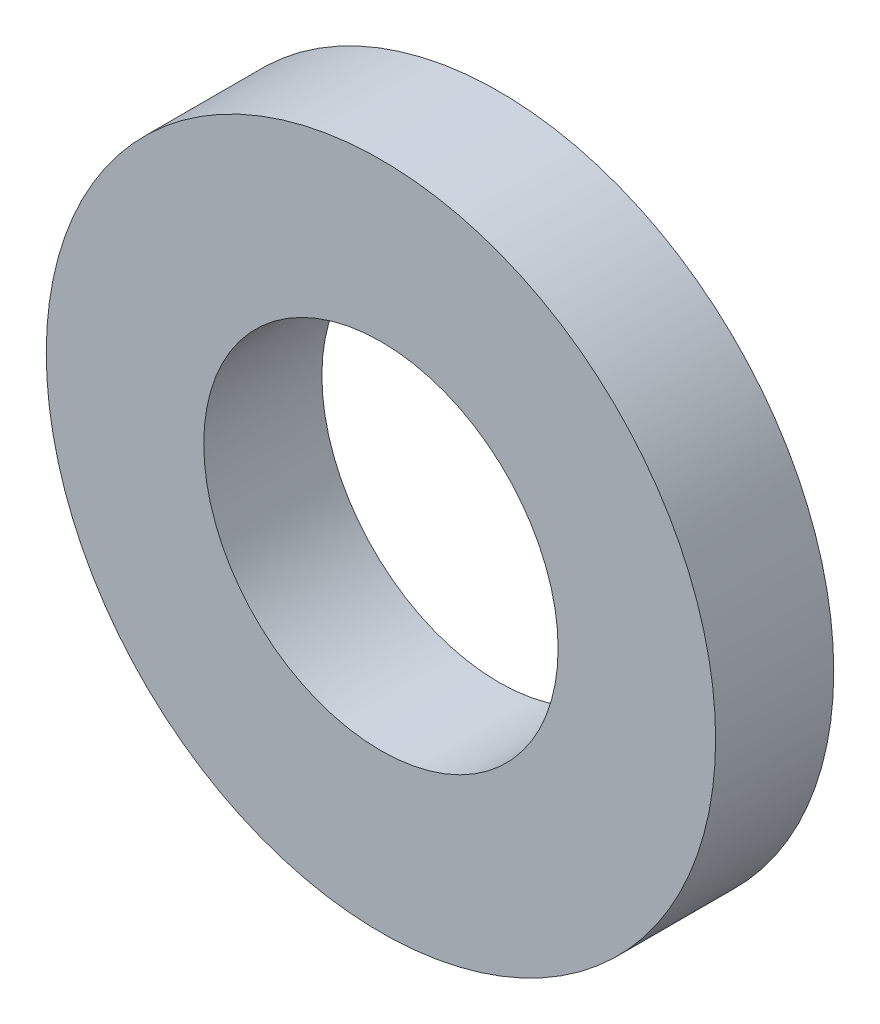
from build123d import *

# Parameters (mm, degrees)
ESQUISSE1_R        = 4.25
ESQUISSE1_R_2      = 2.25
EXTRU_MINCE1_DEPTH = 1.5


with BuildPart() as part:
    # Esquisse1 → Extru.-Mince1 (new body)
    with BuildSketch(Plane.XY):
        Circle(ESQUISSE1_R)
        Circle(ESQUISSE1_R_2, mode=Mode.SUBTRACT)
    extrude(amount=EXTRU_MINCE1_DEPTH)


solid = part.part
